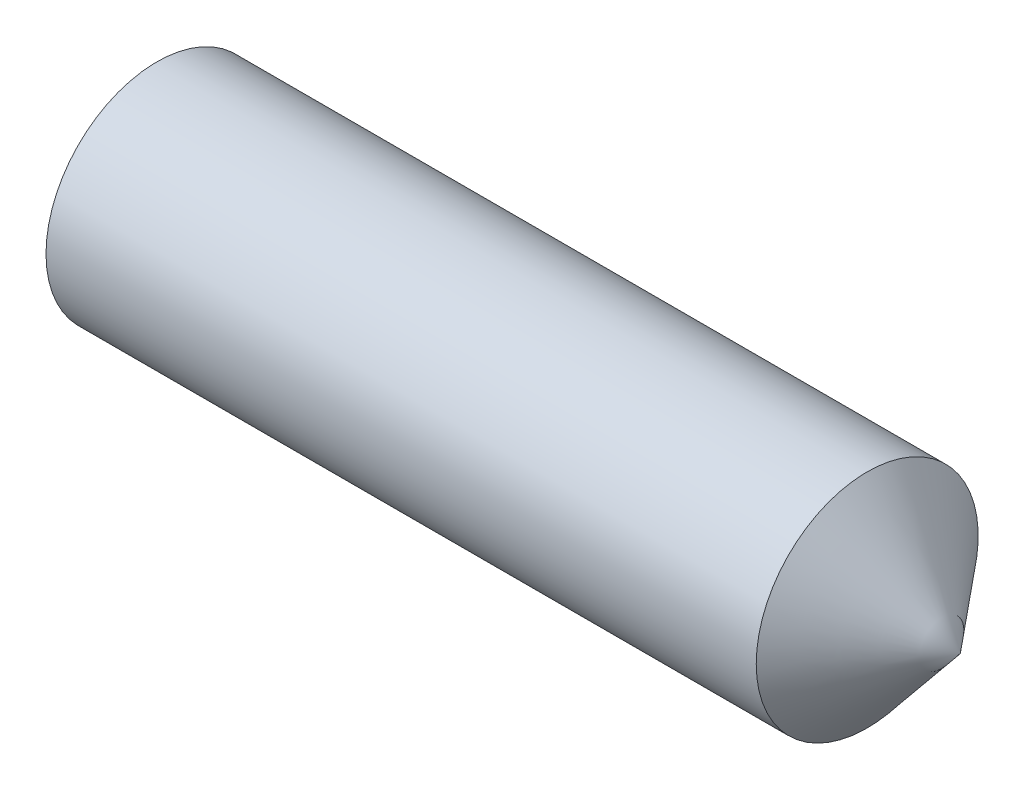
from build123d import *


with BuildPart() as part:
    # Esquisse1 → Base-R_volution (revolve)
    with BuildSketch(Plane.XY, mode=Mode.PRIVATE) as base_r_volution_sk:
        Polygon((-40, 3), (-20.8, 3), (-18.282701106, 0), (-40, 0), align=None)
    revolve(base_r_volution_sk.sketch.rotate(Axis((-50, 0, 0), (1, 0, 0)), 90), axis=Axis((-50, 0, 0), (1, 0, 0)))


solid = part.part
